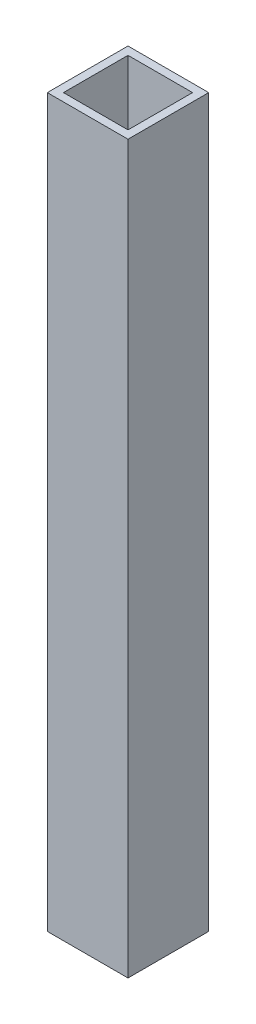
from build123d import *

# Parameters (mm, degrees)
SKETCH_1_W      = 10
SKETCH_1_H      = 10
SKETCH_1_W_2    = 8
SKETCH_1_H_2    = 8
EXTRUDE_1_DEPTH = 90


with BuildPart() as part:
    # Sketch 1 → Extrude 1 (new body)
    with BuildSketch(Plane(origin=(0, 0, 0), x_dir=(1, 0, 0), z_dir=(0, 1, 0))):
        with Locations((5, 5)):
            Rectangle(SKETCH_1_W, SKETCH_1_H)
        with Locations((5, 5)):
            Rectangle(SKETCH_1_W_2, SKETCH_1_H_2, mode=Mode.SUBTRACT)
    extrude(amount=EXTRUDE_1_DEPTH)


solid = part.part
